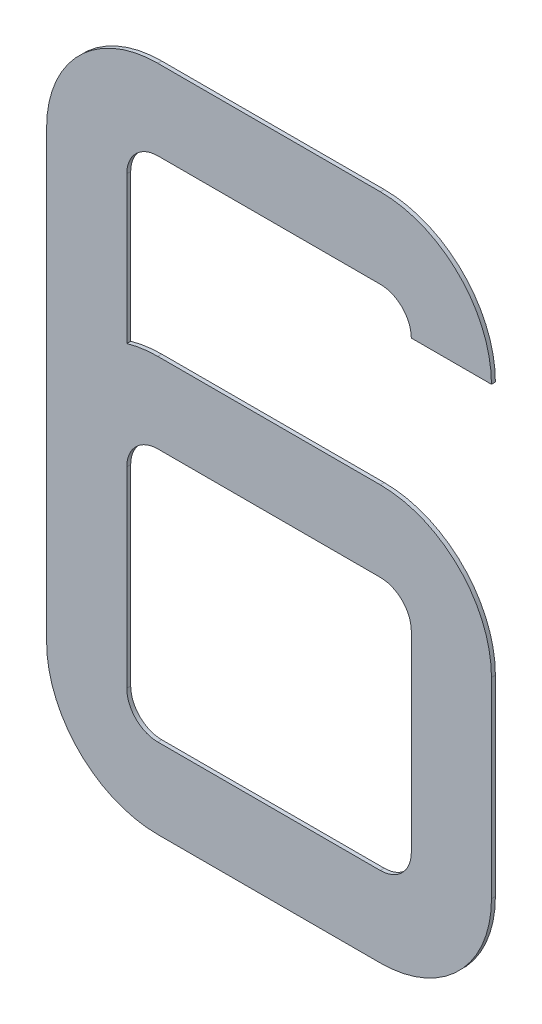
ISO-10303-21;
HEADER;
FILE_DESCRIPTION(('STEP AP214'),'2;1');
FILE_NAME('part.step','',(''),(''),'','','');
FILE_SCHEMA(('AUTOMOTIVE_DESIGN { 1 0 10303 214 1 1 1 1 }'));
ENDSEC;
DATA;
#1=APPLICATION_CONTEXT('core data for automotive mechanical design processes');
#2=APPLICATION_PROTOCOL_DEFINITION('international standard','automotive_design',2000,#1);
#3=PRODUCT_CONTEXT('',#1,'mechanical');
#4=PRODUCT('Part','Part','',(#3));
#5=PRODUCT_RELATED_PRODUCT_CATEGORY('part','',(#4));
#6=PRODUCT_DEFINITION_FORMATION('','',#4);
#7=PRODUCT_DEFINITION_CONTEXT('part definition',#1,'design');
#8=PRODUCT_DEFINITION('design','',#6,#7);
#9=PRODUCT_DEFINITION_SHAPE('','',#8);
#10=(LENGTH_UNIT() NAMED_UNIT(*) SI_UNIT(.MILLI.,.METRE.));
#11=(NAMED_UNIT(*) PLANE_ANGLE_UNIT() SI_UNIT($,.RADIAN.));
#12=(NAMED_UNIT(*) SI_UNIT($,.STERADIAN.) SOLID_ANGLE_UNIT());
#13=UNCERTAINTY_MEASURE_WITH_UNIT(LENGTH_MEASURE(1.E-05),#10,'distance_accuracy_value','');
#14=(GEOMETRIC_REPRESENTATION_CONTEXT(3) GLOBAL_UNCERTAINTY_ASSIGNED_CONTEXT((#13)) GLOBAL_UNIT_ASSIGNED_CONTEXT((#10,
#11,#12)) REPRESENTATION_CONTEXT('',''));
#15=CARTESIAN_POINT('',(0.,0.,0.));
#16=DIRECTION('',(0.,0.,1.));
#17=DIRECTION('',(1.,0.,0.));
#18=AXIS2_PLACEMENT_3D('',#15,#16,#17);
#19=CARTESIAN_POINT('',(2.8305,7.7095,0.1));
#20=DIRECTION('',(0.,0.,1.));
#21=DIRECTION('',(1.,0.,0.));
#22=AXIS2_PLACEMENT_3D('',#19,#20,#21);
#23=PLANE('',#22);
#24=DIRECTION('',(0.,1.,0.));
#25=VECTOR('',#24,1.);
#26=CARTESIAN_POINT('',(5.661,2.8305,0.1));
#27=LINE('',#26,#25);
#28=CARTESIAN_POINT('',(5.661,2.8305,0.1));
#29=VERTEX_POINT('',#28);
#30=CARTESIAN_POINT('',(5.661,7.7095,0.1));
#31=VERTEX_POINT('',#30);
#32=EDGE_CURVE('E261',#29,#31,#27,.T.);
#33=ORIENTED_EDGE('',*,*,#32,.T.);
#34=CARTESIAN_POINT('',(2.8305,7.7095,0.1));
#35=DIRECTION('',(0.,0.,1.));
#36=DIRECTION('',(1.,0.,0.));
#37=AXIS2_PLACEMENT_3D('',#34,#35,#36);
#38=CIRCLE('',#37,2.8305);
#39=CARTESIAN_POINT('',(2.8305,10.54,0.1));
#40=VERTEX_POINT('',#39);
#41=EDGE_CURVE('E355',#31,#40,#38,.T.);
#42=ORIENTED_EDGE('',*,*,#41,.T.);
#43=DIRECTION('',(1.,0.,0.));
#44=VECTOR('',#43,1.);
#45=CARTESIAN_POINT('',(-2.8305,10.54,0.1));
#46=LINE('',#45,#44);
#47=CARTESIAN_POINT('',(-2.8305,10.54,0.1));
#48=VERTEX_POINT('',#47);
#49=EDGE_CURVE('E351',#48,#40,#46,.T.);
#50=ORIENTED_EDGE('',*,*,#49,.F.);
#51=CARTESIAN_POINT('',(-2.8305,7.7095,0.1));
#52=DIRECTION('',(0.,0.,1.));
#53=DIRECTION('',(1.,0.,0.));
#54=AXIS2_PLACEMENT_3D('',#51,#52,#53);
#55=CIRCLE('',#54,2.8305);
#56=CARTESIAN_POINT('',(-3.621,10.4273741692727,0.1));
#57=VERTEX_POINT('',#56);
#58=EDGE_CURVE('E348',#48,#57,#55,.T.);
#59=ORIENTED_EDGE('',*,*,#58,.T.);
#60=DIRECTION('',(0.,1.,0.));
#61=VECTOR('',#60,1.);
#62=CARTESIAN_POINT('',(-3.621,10.4273741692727,0.1));
#63=LINE('',#62,#61);
#64=CARTESIAN_POINT('',(-3.621,14.1695,0.1));
#65=VERTEX_POINT('',#64);
#66=EDGE_CURVE('E345',#57,#65,#63,.T.);
#67=ORIENTED_EDGE('',*,*,#66,.T.);
#68=CARTESIAN_POINT('',(-2.8305,14.1695,0.1));
#69=DIRECTION('',(0.,0.,1.));
#70=DIRECTION('',(1.,0.,0.));
#71=AXIS2_PLACEMENT_3D('',#68,#69,#70);
#72=CIRCLE('',#71,0.7905);
#73=CARTESIAN_POINT('',(-2.8305,14.96,0.1));
#74=VERTEX_POINT('',#73);
#75=EDGE_CURVE('E341',#74,#65,#72,.T.);
#76=ORIENTED_EDGE('',*,*,#75,.F.);
#77=DIRECTION('',(1.,0.,0.));
#78=VECTOR('',#77,1.);
#79=CARTESIAN_POINT('',(-2.8305,14.96,0.1));
#80=LINE('',#79,#78);
#81=CARTESIAN_POINT('',(2.8305,14.96,0.1));
#82=VERTEX_POINT('',#81);
#83=EDGE_CURVE('E338',#74,#82,#80,.T.);
#84=ORIENTED_EDGE('',*,*,#83,.T.);
#85=CARTESIAN_POINT('',(2.8305,14.1695,0.1));
#86=DIRECTION('',(0.,0.,1.));
#87=DIRECTION('',(1.,0.,0.));
#88=AXIS2_PLACEMENT_3D('',#85,#86,#87);
#89=CIRCLE('',#88,0.7905);
#90=CARTESIAN_POINT('',(3.621,14.1695,0.1));
#91=VERTEX_POINT('',#90);
#92=EDGE_CURVE('E334',#91,#82,#89,.T.);
#93=ORIENTED_EDGE('',*,*,#92,.F.);
#94=DIRECTION('',(1.,0.,0.));
#95=VECTOR('',#94,1.);
#96=CARTESIAN_POINT('',(3.621,14.1695,0.1));
#97=LINE('',#96,#95);
#98=CARTESIAN_POINT('',(5.661,14.1695,0.1));
#99=VERTEX_POINT('',#98);
#100=EDGE_CURVE('E331',#91,#99,#97,.T.);
#101=ORIENTED_EDGE('',*,*,#100,.T.);
#102=CARTESIAN_POINT('',(2.8305,14.1695,0.1));
#103=DIRECTION('',(0.,0.,1.));
#104=DIRECTION('',(1.,0.,0.));
#105=AXIS2_PLACEMENT_3D('',#102,#103,#104);
#106=CIRCLE('',#105,2.8305);
#107=CARTESIAN_POINT('',(2.8305,17.,0.1));
#108=VERTEX_POINT('',#107);
#109=EDGE_CURVE('E328',#99,#108,#106,.T.);
#110=ORIENTED_EDGE('',*,*,#109,.T.);
#111=DIRECTION('',(-1.,0.,0.));
#112=VECTOR('',#111,1.);
#113=CARTESIAN_POINT('',(2.8305,17.,0.1));
#114=LINE('',#113,#112);
#115=CARTESIAN_POINT('',(-2.8305,17.,0.1));
#116=VERTEX_POINT('',#115);
#117=EDGE_CURVE('E325',#108,#116,#114,.T.);
#118=ORIENTED_EDGE('',*,*,#117,.T.);
#119=CARTESIAN_POINT('',(-2.8305,14.1695,0.1));
#120=DIRECTION('',(0.,0.,1.));
#121=DIRECTION('',(1.,0.,0.));
#122=AXIS2_PLACEMENT_3D('',#119,#120,#121);
#123=CIRCLE('',#122,2.8305);
#124=CARTESIAN_POINT('',(-5.661,14.1695,0.1));
#125=VERTEX_POINT('',#124);
#126=EDGE_CURVE('E322',#116,#125,#123,.T.);
#127=ORIENTED_EDGE('',*,*,#126,.T.);
#128=DIRECTION('',(0.,-1.,0.));
#129=VECTOR('',#128,1.);
#130=CARTESIAN_POINT('',(-5.661,14.1695,0.1));
#131=LINE('',#130,#129);
#132=CARTESIAN_POINT('',(-5.661,2.8305,0.1));
#133=VERTEX_POINT('',#132);
#134=EDGE_CURVE('E319',#125,#133,#131,.T.);
#135=ORIENTED_EDGE('',*,*,#134,.T.);
#136=CARTESIAN_POINT('',(-2.8305,2.8305,0.1));
#137=DIRECTION('',(0.,0.,1.));
#138=DIRECTION('',(1.,0.,0.));
#139=AXIS2_PLACEMENT_3D('',#136,#137,#138);
#140=CIRCLE('',#139,2.8305);
#141=CARTESIAN_POINT('',(-2.8305,0.,0.1));
#142=VERTEX_POINT('',#141);
#143=EDGE_CURVE('E316',#133,#142,#140,.T.);
#144=ORIENTED_EDGE('',*,*,#143,.T.);
#145=DIRECTION('',(1.,0.,0.));
#146=VECTOR('',#145,1.);
#147=CARTESIAN_POINT('',(-2.8305,0.,0.1));
#148=LINE('',#147,#146);
#149=CARTESIAN_POINT('',(2.8305,0.,0.1));
#150=VERTEX_POINT('',#149);
#151=EDGE_CURVE('E313',#142,#150,#148,.T.);
#152=ORIENTED_EDGE('',*,*,#151,.T.);
#153=CARTESIAN_POINT('',(2.8305,2.8305,0.1));
#154=DIRECTION('',(0.,0.,1.));
#155=DIRECTION('',(1.,0.,0.));
#156=AXIS2_PLACEMENT_3D('',#153,#154,#155);
#157=CIRCLE('',#156,2.8305);
#158=EDGE_CURVE('E309',#150,#29,#157,.T.);
#159=ORIENTED_EDGE('',*,*,#158,.T.);
#160=EDGE_LOOP('',(#33,#42,#50,#59,#67,#76,#84,#93,#101,#110,#118,#127,#135,#144,#152,#159));
#161=FACE_BOUND('',#160,.T.);
#162=CARTESIAN_POINT('',(-2.8305,7.7095,0.1));
#163=DIRECTION('',(0.,0.,1.));
#164=DIRECTION('',(1.,0.,0.));
#165=AXIS2_PLACEMENT_3D('',#162,#163,#164);
#166=CIRCLE('',#165,0.7905);
#167=CARTESIAN_POINT('',(-3.621,7.7095,0.1));
#168=VERTEX_POINT('',#167);
#169=CARTESIAN_POINT('',(-2.8305,8.5,0.1));
#170=VERTEX_POINT('',#169);
#171=EDGE_CURVE('E245',#168,#170,#166,.F.);
#172=ORIENTED_EDGE('',*,*,#171,.T.);
#173=DIRECTION('',(1.,0.,0.));
#174=VECTOR('',#173,1.);
#175=CARTESIAN_POINT('',(2.8305,8.5,0.1));
#176=LINE('',#175,#174);
#177=CARTESIAN_POINT('',(2.8305,8.5,0.1));
#178=VERTEX_POINT('',#177);
#179=EDGE_CURVE('E237',#170,#178,#176,.T.);
#180=ORIENTED_EDGE('',*,*,#179,.T.);
#181=CARTESIAN_POINT('',(2.8305,7.7095,0.1));
#182=DIRECTION('',(0.,0.,1.));
#183=DIRECTION('',(1.,0.,0.));
#184=AXIS2_PLACEMENT_3D('',#181,#182,#183);
#185=CIRCLE('',#184,0.7905);
#186=CARTESIAN_POINT('',(3.621,7.7095,0.1));
#187=VERTEX_POINT('',#186);
#188=EDGE_CURVE('E225',#178,#187,#185,.F.);
#189=ORIENTED_EDGE('',*,*,#188,.T.);
#190=DIRECTION('',(0.,-1.,0.));
#191=VECTOR('',#190,1.);
#192=CARTESIAN_POINT('',(3.621,7.7095,0.1));
#193=LINE('',#192,#191);
#194=CARTESIAN_POINT('',(3.621,2.8305,0.1));
#195=VERTEX_POINT('',#194);
#196=EDGE_CURVE('E231',#187,#195,#193,.T.);
#197=ORIENTED_EDGE('',*,*,#196,.T.);
#198=CARTESIAN_POINT('',(2.8305,2.8305,0.1));
#199=DIRECTION('',(0.,0.,1.));
#200=DIRECTION('',(1.,0.,0.));
#201=AXIS2_PLACEMENT_3D('',#198,#199,#200);
#202=CIRCLE('',#201,0.7905);
#203=CARTESIAN_POINT('',(2.8305,2.04,0.1));
#204=VERTEX_POINT('',#203);
#205=EDGE_CURVE('E480',#195,#204,#202,.F.);
#206=ORIENTED_EDGE('',*,*,#205,.T.);
#207=DIRECTION('',(1.,0.,0.));
#208=VECTOR('',#207,1.);
#209=CARTESIAN_POINT('',(2.8305,2.04,0.1));
#210=LINE('',#209,#208);
#211=CARTESIAN_POINT('',(-2.8305,2.04,0.1));
#212=VERTEX_POINT('',#211);
#213=EDGE_CURVE('E484',#212,#204,#210,.T.);
#214=ORIENTED_EDGE('',*,*,#213,.F.);
#215=CARTESIAN_POINT('',(-2.8305,2.8305,0.1));
#216=DIRECTION('',(0.,0.,1.));
#217=DIRECTION('',(1.,0.,0.));
#218=AXIS2_PLACEMENT_3D('',#215,#216,#217);
#219=CIRCLE('',#218,0.7905);
#220=CARTESIAN_POINT('',(-3.621,2.8305,0.1));
#221=VERTEX_POINT('',#220);
#222=EDGE_CURVE('E487',#212,#221,#219,.F.);
#223=ORIENTED_EDGE('',*,*,#222,.T.);
#224=DIRECTION('',(0.,1.,0.));
#225=VECTOR('',#224,1.);
#226=CARTESIAN_POINT('',(-3.621,7.7095,0.1));
#227=LINE('',#226,#225);
#228=EDGE_CURVE('E255',#221,#168,#227,.T.);
#229=ORIENTED_EDGE('',*,*,#228,.T.);
#230=EDGE_LOOP('',(#172,#180,#189,#197,#206,#214,#223,#229));
#231=FACE_BOUND('',#230,.T.);
#232=ADVANCED_FACE('F14',(#161,#231),#23,.T.);
#233=CARTESIAN_POINT('',(2.8305,7.7095,0.));
#234=DIRECTION('',(0.,0.,1.));
#235=DIRECTION('',(1.,0.,0.));
#236=AXIS2_PLACEMENT_3D('',#233,#234,#235);
#237=PLANE('',#236);
#238=DIRECTION('',(0.,1.,0.));
#239=VECTOR('',#238,1.);
#240=CARTESIAN_POINT('',(5.661,2.8305,0.));
#241=LINE('',#240,#239);
#242=CARTESIAN_POINT('',(5.661,2.8305,0.));
#243=VERTEX_POINT('',#242);
#244=CARTESIAN_POINT('',(5.661,7.7095,0.));
#245=VERTEX_POINT('',#244);
#246=EDGE_CURVE('E247',#243,#245,#241,.T.);
#247=ORIENTED_EDGE('',*,*,#246,.F.);
#248=CARTESIAN_POINT('',(2.8305,2.8305,0.));
#249=DIRECTION('',(0.,0.,1.));
#250=DIRECTION('',(1.,0.,0.));
#251=AXIS2_PLACEMENT_3D('',#248,#249,#250);
#252=CIRCLE('',#251,2.8305);
#253=CARTESIAN_POINT('',(2.8305,0.,0.));
#254=VERTEX_POINT('',#253);
#255=EDGE_CURVE('E259',#254,#243,#252,.T.);
#256=ORIENTED_EDGE('',*,*,#255,.F.);
#257=DIRECTION('',(1.,0.,0.));
#258=VECTOR('',#257,1.);
#259=CARTESIAN_POINT('',(-2.8305,0.,0.));
#260=LINE('',#259,#258);
#261=CARTESIAN_POINT('',(-2.8305,0.,0.));
#262=VERTEX_POINT('',#261);
#263=EDGE_CURVE('E262',#262,#254,#260,.T.);
#264=ORIENTED_EDGE('',*,*,#263,.F.);
#265=CARTESIAN_POINT('',(-2.8305,2.8305,0.));
#266=DIRECTION('',(0.,0.,1.));
#267=DIRECTION('',(1.,0.,0.));
#268=AXIS2_PLACEMENT_3D('',#265,#266,#267);
#269=CIRCLE('',#268,2.8305);
#270=CARTESIAN_POINT('',(-5.661,2.8305,0.));
#271=VERTEX_POINT('',#270);
#272=EDGE_CURVE('E265',#271,#262,#269,.T.);
#273=ORIENTED_EDGE('',*,*,#272,.F.);
#274=DIRECTION('',(0.,-1.,0.));
#275=VECTOR('',#274,1.);
#276=CARTESIAN_POINT('',(-5.661,14.1695,0.));
#277=LINE('',#276,#275);
#278=CARTESIAN_POINT('',(-5.661,14.1695,0.));
#279=VERTEX_POINT('',#278);
#280=EDGE_CURVE('E268',#279,#271,#277,.T.);
#281=ORIENTED_EDGE('',*,*,#280,.F.);
#282=CARTESIAN_POINT('',(-2.8305,14.1695,0.));
#283=DIRECTION('',(0.,0.,1.));
#284=DIRECTION('',(1.,0.,0.));
#285=AXIS2_PLACEMENT_3D('',#282,#283,#284);
#286=CIRCLE('',#285,2.8305);
#287=CARTESIAN_POINT('',(-2.8305,17.,0.));
#288=VERTEX_POINT('',#287);
#289=EDGE_CURVE('E271',#288,#279,#286,.T.);
#290=ORIENTED_EDGE('',*,*,#289,.F.);
#291=DIRECTION('',(-1.,0.,0.));
#292=VECTOR('',#291,1.);
#293=CARTESIAN_POINT('',(2.8305,17.,0.));
#294=LINE('',#293,#292);
#295=CARTESIAN_POINT('',(2.8305,17.,0.));
#296=VERTEX_POINT('',#295);
#297=EDGE_CURVE('E274',#296,#288,#294,.T.);
#298=ORIENTED_EDGE('',*,*,#297,.F.);
#299=CARTESIAN_POINT('',(2.8305,14.1695,0.));
#300=DIRECTION('',(0.,0.,1.));
#301=DIRECTION('',(1.,0.,0.));
#302=AXIS2_PLACEMENT_3D('',#299,#300,#301);
#303=CIRCLE('',#302,2.8305);
#304=CARTESIAN_POINT('',(5.661,14.1695,0.));
#305=VERTEX_POINT('',#304);
#306=EDGE_CURVE('E277',#305,#296,#303,.T.);
#307=ORIENTED_EDGE('',*,*,#306,.F.);
#308=DIRECTION('',(1.,0.,0.));
#309=VECTOR('',#308,1.);
#310=CARTESIAN_POINT('',(3.621,14.1695,0.));
#311=LINE('',#310,#309);
#312=CARTESIAN_POINT('',(3.621,14.1695,0.));
#313=VERTEX_POINT('',#312);
#314=EDGE_CURVE('E280',#313,#305,#311,.T.);
#315=ORIENTED_EDGE('',*,*,#314,.F.);
#316=CARTESIAN_POINT('',(2.8305,14.1695,0.));
#317=DIRECTION('',(0.,0.,1.));
#318=DIRECTION('',(1.,0.,0.));
#319=AXIS2_PLACEMENT_3D('',#316,#317,#318);
#320=CIRCLE('',#319,0.7905);
#321=CARTESIAN_POINT('',(2.8305,14.96,0.));
#322=VERTEX_POINT('',#321);
#323=EDGE_CURVE('E283',#313,#322,#320,.T.);
#324=ORIENTED_EDGE('',*,*,#323,.T.);
#325=DIRECTION('',(1.,0.,0.));
#326=VECTOR('',#325,1.);
#327=CARTESIAN_POINT('',(-2.8305,14.96,0.));
#328=LINE('',#327,#326);
#329=CARTESIAN_POINT('',(-2.8305,14.96,0.));
#330=VERTEX_POINT('',#329);
#331=EDGE_CURVE('E287',#330,#322,#328,.T.);
#332=ORIENTED_EDGE('',*,*,#331,.F.);
#333=CARTESIAN_POINT('',(-2.8305,14.1695,0.));
#334=DIRECTION('',(0.,0.,1.));
#335=DIRECTION('',(1.,0.,0.));
#336=AXIS2_PLACEMENT_3D('',#333,#334,#335);
#337=CIRCLE('',#336,0.7905);
#338=CARTESIAN_POINT('',(-3.621,14.1695,0.));
#339=VERTEX_POINT('',#338);
#340=EDGE_CURVE('E291',#330,#339,#337,.T.);
#341=ORIENTED_EDGE('',*,*,#340,.T.);
#342=DIRECTION('',(0.,1.,0.));
#343=VECTOR('',#342,1.);
#344=CARTESIAN_POINT('',(-3.621,10.4273741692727,0.));
#345=LINE('',#344,#343);
#346=CARTESIAN_POINT('',(-3.621,10.4273741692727,0.));
#347=VERTEX_POINT('',#346);
#348=EDGE_CURVE('E295',#347,#339,#345,.T.);
#349=ORIENTED_EDGE('',*,*,#348,.F.);
#350=CARTESIAN_POINT('',(-2.8305,7.7095,0.));
#351=DIRECTION('',(0.,0.,1.));
#352=DIRECTION('',(1.,0.,0.));
#353=AXIS2_PLACEMENT_3D('',#350,#351,#352);
#354=CIRCLE('',#353,2.8305);
#355=CARTESIAN_POINT('',(-2.8305,10.54,0.));
#356=VERTEX_POINT('',#355);
#357=EDGE_CURVE('E299',#356,#347,#354,.T.);
#358=ORIENTED_EDGE('',*,*,#357,.F.);
#359=DIRECTION('',(1.,0.,0.));
#360=VECTOR('',#359,1.);
#361=CARTESIAN_POINT('',(-2.8305,10.54,0.));
#362=LINE('',#361,#360);
#363=CARTESIAN_POINT('',(2.8305,10.54,0.));
#364=VERTEX_POINT('',#363);
#365=EDGE_CURVE('E302',#356,#364,#362,.T.);
#366=ORIENTED_EDGE('',*,*,#365,.T.);
#367=CARTESIAN_POINT('',(2.8305,7.7095,0.));
#368=DIRECTION('',(0.,0.,1.));
#369=DIRECTION('',(1.,0.,0.));
#370=AXIS2_PLACEMENT_3D('',#367,#368,#369);
#371=CIRCLE('',#370,2.8305);
#372=EDGE_CURVE('E253',#245,#364,#371,.T.);
#373=ORIENTED_EDGE('',*,*,#372,.F.);
#374=EDGE_LOOP('',(#247,#256,#264,#273,#281,#290,#298,#307,#315,#324,#332,#341,#349,#358,#366,#373));
#375=FACE_BOUND('',#374,.T.);
#376=DIRECTION('',(1.,0.,0.));
#377=VECTOR('',#376,1.);
#378=CARTESIAN_POINT('',(2.8305,8.5,0.));
#379=LINE('',#378,#377);
#380=CARTESIAN_POINT('',(-2.8305,8.5,0.));
#381=VERTEX_POINT('',#380);
#382=CARTESIAN_POINT('',(2.8305,8.5,0.));
#383=VERTEX_POINT('',#382);
#384=EDGE_CURVE('E9',#381,#383,#379,.T.);
#385=ORIENTED_EDGE('',*,*,#384,.F.);
#386=CARTESIAN_POINT('',(-2.8305,7.7095,0.));
#387=DIRECTION('',(0.,0.,1.));
#388=DIRECTION('',(1.,0.,0.));
#389=AXIS2_PLACEMENT_3D('',#386,#387,#388);
#390=CIRCLE('',#389,0.7905);
#391=CARTESIAN_POINT('',(-3.621,7.7095,0.));
#392=VERTEX_POINT('',#391);
#393=EDGE_CURVE('E23',#392,#381,#390,.F.);
#394=ORIENTED_EDGE('',*,*,#393,.F.);
#395=DIRECTION('',(0.,1.,0.));
#396=VECTOR('',#395,1.);
#397=CARTESIAN_POINT('',(-3.621,7.7095,0.));
#398=LINE('',#397,#396);
#399=CARTESIAN_POINT('',(-3.621,2.8305,0.));
#400=VERTEX_POINT('',#399);
#401=EDGE_CURVE('E434',#400,#392,#398,.T.);
#402=ORIENTED_EDGE('',*,*,#401,.F.);
#403=CARTESIAN_POINT('',(-2.8305,2.8305,0.));
#404=DIRECTION('',(0.,0.,1.));
#405=DIRECTION('',(1.,0.,0.));
#406=AXIS2_PLACEMENT_3D('',#403,#404,#405);
#407=CIRCLE('',#406,0.7905);
#408=CARTESIAN_POINT('',(-2.8305,2.04,0.));
#409=VERTEX_POINT('',#408);
#410=EDGE_CURVE('E431',#409,#400,#407,.F.);
#411=ORIENTED_EDGE('',*,*,#410,.F.);
#412=DIRECTION('',(1.,0.,0.));
#413=VECTOR('',#412,1.);
#414=CARTESIAN_POINT('',(2.8305,2.04,0.));
#415=LINE('',#414,#413);
#416=CARTESIAN_POINT('',(2.8305,2.04,0.));
#417=VERTEX_POINT('',#416);
#418=EDGE_CURVE('E427',#409,#417,#415,.T.);
#419=ORIENTED_EDGE('',*,*,#418,.T.);
#420=CARTESIAN_POINT('',(2.8305,2.8305,0.));
#421=DIRECTION('',(0.,0.,1.));
#422=DIRECTION('',(1.,0.,0.));
#423=AXIS2_PLACEMENT_3D('',#420,#421,#422);
#424=CIRCLE('',#423,0.7905);
#425=CARTESIAN_POINT('',(3.621,2.8305,0.));
#426=VERTEX_POINT('',#425);
#427=EDGE_CURVE('E424',#426,#417,#424,.F.);
#428=ORIENTED_EDGE('',*,*,#427,.F.);
#429=DIRECTION('',(0.,-1.,0.));
#430=VECTOR('',#429,1.);
#431=CARTESIAN_POINT('',(3.621,7.7095,0.));
#432=LINE('',#431,#430);
#433=CARTESIAN_POINT('',(3.621,7.7095,0.));
#434=VERTEX_POINT('',#433);
#435=EDGE_CURVE('E421',#434,#426,#432,.T.);
#436=ORIENTED_EDGE('',*,*,#435,.F.);
#437=CARTESIAN_POINT('',(2.8305,7.7095,0.));
#438=DIRECTION('',(0.,0.,1.));
#439=DIRECTION('',(1.,0.,0.));
#440=AXIS2_PLACEMENT_3D('',#437,#438,#439);
#441=CIRCLE('',#440,0.7905);
#442=EDGE_CURVE('E365',#383,#434,#441,.F.);
#443=ORIENTED_EDGE('',*,*,#442,.F.);
#444=EDGE_LOOP('',(#385,#394,#402,#411,#419,#428,#436,#443));
#445=FACE_BOUND('',#444,.T.);
#446=ADVANCED_FACE('F448',(#375,#445),#237,.F.);
#447=CARTESIAN_POINT('',(5.661,2.8305,0.1));
#448=DIRECTION('',(-1.,0.,0.));
#449=DIRECTION('',(0.,0.,1.));
#450=AXIS2_PLACEMENT_3D('',#447,#448,#449);
#451=PLANE('',#450);
#452=ORIENTED_EDGE('',*,*,#246,.T.);
#453=DIRECTION('',(0.,0.,-1.));
#454=VECTOR('',#453,1.);
#455=CARTESIAN_POINT('',(5.661,7.7095,0.1));
#456=LINE('',#455,#454);
#457=EDGE_CURVE('E361',#31,#245,#456,.T.);
#458=ORIENTED_EDGE('',*,*,#457,.F.);
#459=ORIENTED_EDGE('',*,*,#32,.F.);
#460=DIRECTION('',(0.,0.,-1.));
#461=VECTOR('',#460,1.);
#462=CARTESIAN_POINT('',(5.661,2.8305,0.1));
#463=LINE('',#462,#461);
#464=EDGE_CURVE('E312',#29,#243,#463,.T.);
#465=ORIENTED_EDGE('',*,*,#464,.T.);
#466=EDGE_LOOP('',(#452,#458,#459,#465));
#467=FACE_BOUND('',#466,.T.);
#468=ADVANCED_FACE('F16',(#467),#451,.F.);
#469=CARTESIAN_POINT('',(2.8305,7.7095,0.1));
#470=DIRECTION('',(0.,0.,-1.));
#471=DIRECTION('',(-1.,0.,0.));
#472=AXIS2_PLACEMENT_3D('',#469,#470,#471);
#473=CYLINDRICAL_SURFACE('',#472,2.8305);
#474=ORIENTED_EDGE('',*,*,#372,.T.);
#475=DIRECTION('',(0.,0.,-1.));
#476=VECTOR('',#475,1.);
#477=CARTESIAN_POINT('',(2.8305,10.54,0.1));
#478=LINE('',#477,#476);
#479=EDGE_CURVE('E366',#40,#364,#478,.T.);
#480=ORIENTED_EDGE('',*,*,#479,.F.);
#481=ORIENTED_EDGE('',*,*,#41,.F.);
#482=ORIENTED_EDGE('',*,*,#457,.T.);
#483=EDGE_LOOP('',(#474,#480,#481,#482));
#484=FACE_BOUND('',#483,.T.);
#485=ADVANCED_FACE('F579',(#484),#473,.T.);
#486=CARTESIAN_POINT('',(-2.8305,10.54,0.1));
#487=DIRECTION('',(0.,1.,0.));
#488=DIRECTION('',(0.,0.,1.));
#489=AXIS2_PLACEMENT_3D('',#486,#487,#488);
#490=PLANE('',#489);
#491=ORIENTED_EDGE('',*,*,#365,.F.);
#492=DIRECTION('',(0.,0.,-1.));
#493=VECTOR('',#492,1.);
#494=CARTESIAN_POINT('',(-2.8305,10.54,0.1));
#495=LINE('',#494,#493);
#496=EDGE_CURVE('E369',#48,#356,#495,.T.);
#497=ORIENTED_EDGE('',*,*,#496,.F.);
#498=ORIENTED_EDGE('',*,*,#49,.T.);
#499=ORIENTED_EDGE('',*,*,#479,.T.);
#500=EDGE_LOOP('',(#491,#497,#498,#499));
#501=FACE_BOUND('',#500,.T.);
#502=ADVANCED_FACE('F576',(#501),#490,.T.);
#503=CARTESIAN_POINT('',(-2.8305,7.7095,0.1));
#504=DIRECTION('',(0.,0.,-1.));
#505=DIRECTION('',(-1.,0.,0.));
#506=AXIS2_PLACEMENT_3D('',#503,#504,#505);
#507=CYLINDRICAL_SURFACE('',#506,2.8305);
#508=ORIENTED_EDGE('',*,*,#357,.T.);
#509=DIRECTION('',(0.,0.,-1.));
#510=VECTOR('',#509,1.);
#511=CARTESIAN_POINT('',(-3.621,10.4273741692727,0.1));
#512=LINE('',#511,#510);
#513=EDGE_CURVE('E372',#57,#347,#512,.T.);
#514=ORIENTED_EDGE('',*,*,#513,.F.);
#515=ORIENTED_EDGE('',*,*,#58,.F.);
#516=ORIENTED_EDGE('',*,*,#496,.T.);
#517=EDGE_LOOP('',(#508,#514,#515,#516));
#518=FACE_BOUND('',#517,.T.);
#519=ADVANCED_FACE('F572',(#518),#507,.T.);
#520=CARTESIAN_POINT('',(-3.621,10.4273741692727,0.1));
#521=DIRECTION('',(-1.,0.,0.));
#522=DIRECTION('',(0.,0.,1.));
#523=AXIS2_PLACEMENT_3D('',#520,#521,#522);
#524=PLANE('',#523);
#525=ORIENTED_EDGE('',*,*,#348,.T.);
#526=DIRECTION('',(0.,0.,-1.));
#527=VECTOR('',#526,1.);
#528=CARTESIAN_POINT('',(-3.621,14.1695,0.1));
#529=LINE('',#528,#527);
#530=EDGE_CURVE('E376',#65,#339,#529,.T.);
#531=ORIENTED_EDGE('',*,*,#530,.F.);
#532=ORIENTED_EDGE('',*,*,#66,.F.);
#533=ORIENTED_EDGE('',*,*,#513,.T.);
#534=EDGE_LOOP('',(#525,#531,#532,#533));
#535=FACE_BOUND('',#534,.T.);
#536=ADVANCED_FACE('F568',(#535),#524,.F.);
#537=CARTESIAN_POINT('',(-2.8305,14.1695,0.1));
#538=DIRECTION('',(0.,0.,-1.));
#539=DIRECTION('',(-1.,0.,0.));
#540=AXIS2_PLACEMENT_3D('',#537,#538,#539);
#541=CYLINDRICAL_SURFACE('',#540,0.7905);
#542=ORIENTED_EDGE('',*,*,#340,.F.);
#543=DIRECTION('',(0.,0.,-1.));
#544=VECTOR('',#543,1.);
#545=CARTESIAN_POINT('',(-2.8305,14.96,0.1));
#546=LINE('',#545,#544);
#547=EDGE_CURVE('E379',#74,#330,#546,.T.);
#548=ORIENTED_EDGE('',*,*,#547,.F.);
#549=ORIENTED_EDGE('',*,*,#75,.T.);
#550=ORIENTED_EDGE('',*,*,#530,.T.);
#551=EDGE_LOOP('',(#542,#548,#549,#550));
#552=FACE_BOUND('',#551,.T.);
#553=ADVANCED_FACE('F564',(#552),#541,.F.);
#554=CARTESIAN_POINT('',(-2.8305,14.96,0.1));
#555=DIRECTION('',(0.,1.,0.));
#556=DIRECTION('',(0.,0.,1.));
#557=AXIS2_PLACEMENT_3D('',#554,#555,#556);
#558=PLANE('',#557);
#559=ORIENTED_EDGE('',*,*,#331,.T.);
#560=DIRECTION('',(0.,0.,-1.));
#561=VECTOR('',#560,1.);
#562=CARTESIAN_POINT('',(2.8305,14.96,0.1));
#563=LINE('',#562,#561);
#564=EDGE_CURVE('E382',#82,#322,#563,.T.);
#565=ORIENTED_EDGE('',*,*,#564,.F.);
#566=ORIENTED_EDGE('',*,*,#83,.F.);
#567=ORIENTED_EDGE('',*,*,#547,.T.);
#568=EDGE_LOOP('',(#559,#565,#566,#567));
#569=FACE_BOUND('',#568,.T.);
#570=ADVANCED_FACE('F560',(#569),#558,.F.);
#571=CARTESIAN_POINT('',(2.8305,14.1695,0.1));
#572=DIRECTION('',(0.,0.,-1.));
#573=DIRECTION('',(-1.,0.,0.));
#574=AXIS2_PLACEMENT_3D('',#571,#572,#573);
#575=CYLINDRICAL_SURFACE('',#574,0.7905);
#576=ORIENTED_EDGE('',*,*,#323,.F.);
#577=DIRECTION('',(0.,0.,-1.));
#578=VECTOR('',#577,1.);
#579=CARTESIAN_POINT('',(3.621,14.1695,0.1));
#580=LINE('',#579,#578);
#581=EDGE_CURVE('E385',#91,#313,#580,.T.);
#582=ORIENTED_EDGE('',*,*,#581,.F.);
#583=ORIENTED_EDGE('',*,*,#92,.T.);
#584=ORIENTED_EDGE('',*,*,#564,.T.);
#585=EDGE_LOOP('',(#576,#582,#583,#584));
#586=FACE_BOUND('',#585,.T.);
#587=ADVANCED_FACE('F556',(#586),#575,.F.);
#588=CARTESIAN_POINT('',(3.621,14.1695,0.1));
#589=DIRECTION('',(0.,1.,0.));
#590=DIRECTION('',(0.,0.,1.));
#591=AXIS2_PLACEMENT_3D('',#588,#589,#590);
#592=PLANE('',#591);
#593=ORIENTED_EDGE('',*,*,#314,.T.);
#594=DIRECTION('',(0.,0.,-1.));
#595=VECTOR('',#594,1.);
#596=CARTESIAN_POINT('',(5.661,14.1695,0.1));
#597=LINE('',#596,#595);
#598=EDGE_CURVE('E388',#99,#305,#597,.T.);
#599=ORIENTED_EDGE('',*,*,#598,.F.);
#600=ORIENTED_EDGE('',*,*,#100,.F.);
#601=ORIENTED_EDGE('',*,*,#581,.T.);
#602=EDGE_LOOP('',(#593,#599,#600,#601));
#603=FACE_BOUND('',#602,.T.);
#604=ADVANCED_FACE('F552',(#603),#592,.F.);
#605=CARTESIAN_POINT('',(2.8305,14.1695,0.1));
#606=DIRECTION('',(0.,0.,-1.));
#607=DIRECTION('',(-1.,0.,0.));
#608=AXIS2_PLACEMENT_3D('',#605,#606,#607);
#609=CYLINDRICAL_SURFACE('',#608,2.8305);
#610=ORIENTED_EDGE('',*,*,#306,.T.);
#611=DIRECTION('',(0.,0.,-1.));
#612=VECTOR('',#611,1.);
#613=CARTESIAN_POINT('',(2.8305,17.,0.1));
#614=LINE('',#613,#612);
#615=EDGE_CURVE('E392',#108,#296,#614,.T.);
#616=ORIENTED_EDGE('',*,*,#615,.F.);
#617=ORIENTED_EDGE('',*,*,#109,.F.);
#618=ORIENTED_EDGE('',*,*,#598,.T.);
#619=EDGE_LOOP('',(#610,#616,#617,#618));
#620=FACE_BOUND('',#619,.T.);
#621=ADVANCED_FACE('F548',(#620),#609,.T.);
#622=CARTESIAN_POINT('',(2.8305,17.,0.1));
#623=DIRECTION('',(0.,-1.,0.));
#624=DIRECTION('',(0.,0.,-1.));
#625=AXIS2_PLACEMENT_3D('',#622,#623,#624);
#626=PLANE('',#625);
#627=ORIENTED_EDGE('',*,*,#297,.T.);
#628=DIRECTION('',(0.,0.,-1.));
#629=VECTOR('',#628,1.);
#630=CARTESIAN_POINT('',(-2.8305,17.,0.1));
#631=LINE('',#630,#629);
#632=EDGE_CURVE('E396',#116,#288,#631,.T.);
#633=ORIENTED_EDGE('',*,*,#632,.F.);
#634=ORIENTED_EDGE('',*,*,#117,.F.);
#635=ORIENTED_EDGE('',*,*,#615,.T.);
#636=EDGE_LOOP('',(#627,#633,#634,#635));
#637=FACE_BOUND('',#636,.T.);
#638=ADVANCED_FACE('F544',(#637),#626,.F.);
#639=CARTESIAN_POINT('',(-2.8305,14.1695,0.1));
#640=DIRECTION('',(0.,0.,-1.));
#641=DIRECTION('',(-1.,0.,0.));
#642=AXIS2_PLACEMENT_3D('',#639,#640,#641);
#643=CYLINDRICAL_SURFACE('',#642,2.8305);
#644=ORIENTED_EDGE('',*,*,#289,.T.);
#645=DIRECTION('',(0.,0.,-1.));
#646=VECTOR('',#645,1.);
#647=CARTESIAN_POINT('',(-5.661,14.1695,0.1));
#648=LINE('',#647,#646);
#649=EDGE_CURVE('E400',#125,#279,#648,.T.);
#650=ORIENTED_EDGE('',*,*,#649,.F.);
#651=ORIENTED_EDGE('',*,*,#126,.F.);
#652=ORIENTED_EDGE('',*,*,#632,.T.);
#653=EDGE_LOOP('',(#644,#650,#651,#652));
#654=FACE_BOUND('',#653,.T.);
#655=ADVANCED_FACE('F540',(#654),#643,.T.);
#656=CARTESIAN_POINT('',(-5.661,14.1695,0.1));
#657=DIRECTION('',(1.,0.,0.));
#658=DIRECTION('',(0.,1.,0.));
#659=AXIS2_PLACEMENT_3D('',#656,#657,#658);
#660=PLANE('',#659);
#661=ORIENTED_EDGE('',*,*,#280,.T.);
#662=DIRECTION('',(0.,0.,-1.));
#663=VECTOR('',#662,1.);
#664=CARTESIAN_POINT('',(-5.661,2.8305,0.1));
#665=LINE('',#664,#663);
#666=EDGE_CURVE('E404',#133,#271,#665,.T.);
#667=ORIENTED_EDGE('',*,*,#666,.F.);
#668=ORIENTED_EDGE('',*,*,#134,.F.);
#669=ORIENTED_EDGE('',*,*,#649,.T.);
#670=EDGE_LOOP('',(#661,#667,#668,#669));
#671=FACE_BOUND('',#670,.T.);
#672=ADVANCED_FACE('F536',(#671),#660,.F.);
#673=CARTESIAN_POINT('',(-2.8305,2.8305,0.1));
#674=DIRECTION('',(0.,0.,-1.));
#675=DIRECTION('',(-1.,0.,0.));
#676=AXIS2_PLACEMENT_3D('',#673,#674,#675);
#677=CYLINDRICAL_SURFACE('',#676,2.8305);
#678=ORIENTED_EDGE('',*,*,#272,.T.);
#679=DIRECTION('',(0.,0.,-1.));
#680=VECTOR('',#679,1.);
#681=CARTESIAN_POINT('',(-2.8305,0.,0.1));
#682=LINE('',#681,#680);
#683=EDGE_CURVE('E408',#142,#262,#682,.T.);
#684=ORIENTED_EDGE('',*,*,#683,.F.);
#685=ORIENTED_EDGE('',*,*,#143,.F.);
#686=ORIENTED_EDGE('',*,*,#666,.T.);
#687=EDGE_LOOP('',(#678,#684,#685,#686));
#688=FACE_BOUND('',#687,.T.);
#689=ADVANCED_FACE('F532',(#688),#677,.T.);
#690=CARTESIAN_POINT('',(-2.8305,0.,0.1));
#691=DIRECTION('',(0.,1.,0.));
#692=DIRECTION('',(0.,0.,1.));
#693=AXIS2_PLACEMENT_3D('',#690,#691,#692);
#694=PLANE('',#693);
#695=ORIENTED_EDGE('',*,*,#263,.T.);
#696=DIRECTION('',(0.,0.,-1.));
#697=VECTOR('',#696,1.);
#698=CARTESIAN_POINT('',(2.8305,0.,0.1));
#699=LINE('',#698,#697);
#700=EDGE_CURVE('E412',#150,#254,#699,.T.);
#701=ORIENTED_EDGE('',*,*,#700,.F.);
#702=ORIENTED_EDGE('',*,*,#151,.F.);
#703=ORIENTED_EDGE('',*,*,#683,.T.);
#704=EDGE_LOOP('',(#695,#701,#702,#703));
#705=FACE_BOUND('',#704,.T.);
#706=ADVANCED_FACE('F528',(#705),#694,.F.);
#707=CARTESIAN_POINT('',(2.8305,2.8305,0.1));
#708=DIRECTION('',(0.,0.,-1.));
#709=DIRECTION('',(-1.,0.,0.));
#710=AXIS2_PLACEMENT_3D('',#707,#708,#709);
#711=CYLINDRICAL_SURFACE('',#710,2.8305);
#712=ORIENTED_EDGE('',*,*,#255,.T.);
#713=ORIENTED_EDGE('',*,*,#464,.F.);
#714=ORIENTED_EDGE('',*,*,#158,.F.);
#715=ORIENTED_EDGE('',*,*,#700,.T.);
#716=EDGE_LOOP('',(#712,#713,#714,#715));
#717=FACE_BOUND('',#716,.T.);
#718=ADVANCED_FACE('F525',(#717),#711,.T.);
#719=CARTESIAN_POINT('',(2.8305,8.5,1.1));
#720=DIRECTION('',(0.,-1.,0.));
#721=DIRECTION('',(0.,0.,-1.));
#722=AXIS2_PLACEMENT_3D('',#719,#720,#721);
#723=PLANE('',#722);
#724=DIRECTION('',(0.,0.,-1.));
#725=VECTOR('',#724,1.);
#726=CARTESIAN_POINT('',(-2.8305,8.5,1.1));
#727=LINE('',#726,#725);
#728=EDGE_CURVE('E232',#170,#381,#727,.T.);
#729=ORIENTED_EDGE('',*,*,#728,.T.);
#730=ORIENTED_EDGE('',*,*,#384,.T.);
#731=DIRECTION('',(0.,0.,-1.));
#732=VECTOR('',#731,1.);
#733=CARTESIAN_POINT('',(2.8305,8.5,1.1));
#734=LINE('',#733,#732);
#735=EDGE_CURVE('E44',#178,#383,#734,.T.);
#736=ORIENTED_EDGE('',*,*,#735,.F.);
#737=ORIENTED_EDGE('',*,*,#179,.F.);
#738=EDGE_LOOP('',(#729,#730,#736,#737));
#739=FACE_BOUND('',#738,.T.);
#740=ADVANCED_FACE('F236',(#739),#723,.T.);
#741=CARTESIAN_POINT('',(-2.8305,7.7095,1.1));
#742=DIRECTION('',(0.,0.,-1.));
#743=DIRECTION('',(-1.,0.,0.));
#744=AXIS2_PLACEMENT_3D('',#741,#742,#743);
#745=CYLINDRICAL_SURFACE('',#744,0.7905);
#746=DIRECTION('',(0.,0.,-1.));
#747=VECTOR('',#746,1.);
#748=CARTESIAN_POINT('',(-3.621,7.7095,1.1));
#749=LINE('',#748,#747);
#750=EDGE_CURVE('E443',#168,#392,#749,.T.);
#751=ORIENTED_EDGE('',*,*,#750,.T.);
#752=ORIENTED_EDGE('',*,*,#393,.T.);
#753=ORIENTED_EDGE('',*,*,#728,.F.);
#754=ORIENTED_EDGE('',*,*,#171,.F.);
#755=EDGE_LOOP('',(#751,#752,#753,#754));
#756=FACE_BOUND('',#755,.T.);
#757=ADVANCED_FACE('F441',(#756),#745,.F.);
#758=CARTESIAN_POINT('',(-3.621,7.7095,1.1));
#759=DIRECTION('',(1.,0.,0.));
#760=DIRECTION('',(0.,0.,-1.));
#761=AXIS2_PLACEMENT_3D('',#758,#759,#760);
#762=PLANE('',#761);
#763=DIRECTION('',(0.,0.,-1.));
#764=VECTOR('',#763,1.);
#765=CARTESIAN_POINT('',(-3.621,2.8305,1.1));
#766=LINE('',#765,#764);
#767=EDGE_CURVE('E472',#221,#400,#766,.T.);
#768=ORIENTED_EDGE('',*,*,#767,.T.);
#769=ORIENTED_EDGE('',*,*,#401,.T.);
#770=ORIENTED_EDGE('',*,*,#750,.F.);
#771=ORIENTED_EDGE('',*,*,#228,.F.);
#772=EDGE_LOOP('',(#768,#769,#770,#771));
#773=FACE_BOUND('',#772,.T.);
#774=ADVANCED_FACE('F496',(#773),#762,.T.);
#775=CARTESIAN_POINT('',(-2.8305,2.8305,1.1));
#776=DIRECTION('',(0.,0.,-1.));
#777=DIRECTION('',(-1.,0.,0.));
#778=AXIS2_PLACEMENT_3D('',#775,#776,#777);
#779=CYLINDRICAL_SURFACE('',#778,0.7905);
#780=DIRECTION('',(0.,0.,-1.));
#781=VECTOR('',#780,1.);
#782=CARTESIAN_POINT('',(-2.8305,2.04,1.1));
#783=LINE('',#782,#781);
#784=EDGE_CURVE('E468',#212,#409,#783,.T.);
#785=ORIENTED_EDGE('',*,*,#784,.T.);
#786=ORIENTED_EDGE('',*,*,#410,.T.);
#787=ORIENTED_EDGE('',*,*,#767,.F.);
#788=ORIENTED_EDGE('',*,*,#222,.F.);
#789=EDGE_LOOP('',(#785,#786,#787,#788));
#790=FACE_BOUND('',#789,.T.);
#791=ADVANCED_FACE('F498',(#790),#779,.F.);
#792=CARTESIAN_POINT('',(2.8305,2.04,1.1));
#793=DIRECTION('',(0.,-1.,0.));
#794=DIRECTION('',(1.,0.,0.));
#795=AXIS2_PLACEMENT_3D('',#792,#793,#794);
#796=PLANE('',#795);
#797=ORIENTED_EDGE('',*,*,#213,.T.);
#798=DIRECTION('',(0.,0.,-1.));
#799=VECTOR('',#798,1.);
#800=CARTESIAN_POINT('',(2.8305,2.04,1.1));
#801=LINE('',#800,#799);
#802=EDGE_CURVE('E462',#204,#417,#801,.T.);
#803=ORIENTED_EDGE('',*,*,#802,.T.);
#804=ORIENTED_EDGE('',*,*,#418,.F.);
#805=ORIENTED_EDGE('',*,*,#784,.F.);
#806=EDGE_LOOP('',(#797,#803,#804,#805));
#807=FACE_BOUND('',#806,.T.);
#808=ADVANCED_FACE('F502',(#807),#796,.F.);
#809=CARTESIAN_POINT('',(2.8305,2.8305,1.1));
#810=DIRECTION('',(0.,0.,-1.));
#811=DIRECTION('',(-1.,0.,0.));
#812=AXIS2_PLACEMENT_3D('',#809,#810,#811);
#813=CYLINDRICAL_SURFACE('',#812,0.7905);
#814=DIRECTION('',(0.,0.,-1.));
#815=VECTOR('',#814,1.);
#816=CARTESIAN_POINT('',(3.621,2.8305,1.1));
#817=LINE('',#816,#815);
#818=EDGE_CURVE('E456',#195,#426,#817,.T.);
#819=ORIENTED_EDGE('',*,*,#818,.T.);
#820=ORIENTED_EDGE('',*,*,#427,.T.);
#821=ORIENTED_EDGE('',*,*,#802,.F.);
#822=ORIENTED_EDGE('',*,*,#205,.F.);
#823=EDGE_LOOP('',(#819,#820,#821,#822));
#824=FACE_BOUND('',#823,.T.);
#825=ADVANCED_FACE('F505',(#824),#813,.F.);
#826=CARTESIAN_POINT('',(3.621,2.8305,1.1));
#827=DIRECTION('',(-1.,0.,0.));
#828=DIRECTION('',(0.,0.,1.));
#829=AXIS2_PLACEMENT_3D('',#826,#827,#828);
#830=PLANE('',#829);
#831=DIRECTION('',(0.,0.,-1.));
#832=VECTOR('',#831,1.);
#833=CARTESIAN_POINT('',(3.621,7.7095,1.1));
#834=LINE('',#833,#832);
#835=EDGE_CURVE('E35',#187,#434,#834,.T.);
#836=ORIENTED_EDGE('',*,*,#835,.T.);
#837=ORIENTED_EDGE('',*,*,#435,.T.);
#838=ORIENTED_EDGE('',*,*,#818,.F.);
#839=ORIENTED_EDGE('',*,*,#196,.F.);
#840=EDGE_LOOP('',(#836,#837,#838,#839));
#841=FACE_BOUND('',#840,.T.);
#842=ADVANCED_FACE('F452',(#841),#830,.T.);
#843=CARTESIAN_POINT('',(2.8305,7.7095,1.1));
#844=DIRECTION('',(0.,0.,-1.));
#845=DIRECTION('',(-1.,0.,0.));
#846=AXIS2_PLACEMENT_3D('',#843,#844,#845);
#847=CYLINDRICAL_SURFACE('',#846,0.7905);
#848=ORIENTED_EDGE('',*,*,#735,.T.);
#849=ORIENTED_EDGE('',*,*,#442,.T.);
#850=ORIENTED_EDGE('',*,*,#835,.F.);
#851=ORIENTED_EDGE('',*,*,#188,.F.);
#852=EDGE_LOOP('',(#848,#849,#850,#851));
#853=FACE_BOUND('',#852,.T.);
#854=ADVANCED_FACE('F226',(#853),#847,.F.);
#855=CLOSED_SHELL('',(#232,#446,#468,#485,#502,#519,#536,#553,#570,#587,#604,#621,#638,#655,
#672,#689,#706,#718,#740,#757,#774,#791,#808,#825,#842,#854));
#856=MANIFOLD_SOLID_BREP('B1',#855);
#857=ADVANCED_BREP_SHAPE_REPRESENTATION('',(#18,#856),#14);
#858=SHAPE_DEFINITION_REPRESENTATION(#9,#857);
ENDSEC;
END-ISO-10303-21;
